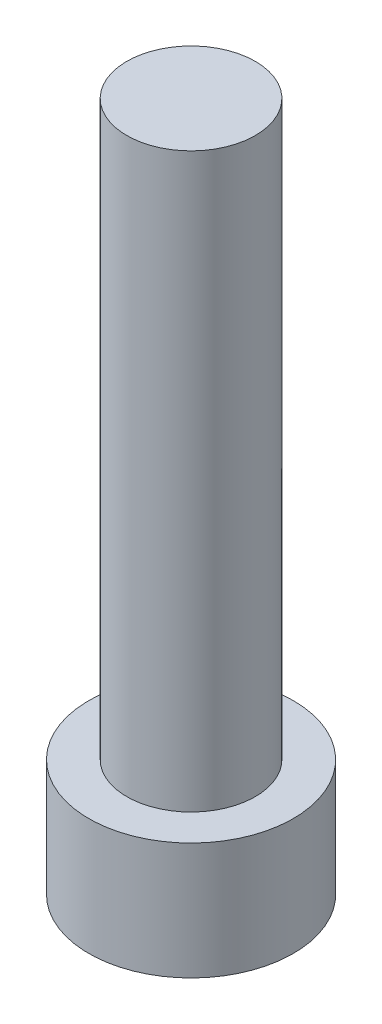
ISO-10303-21;
HEADER;
FILE_DESCRIPTION(('STEP AP214'),'2;1');
FILE_NAME('part.step','',(''),(''),'','','');
FILE_SCHEMA(('AUTOMOTIVE_DESIGN { 1 0 10303 214 1 1 1 1 }'));
ENDSEC;
DATA;
#1=APPLICATION_CONTEXT('core data for automotive mechanical design processes');
#2=APPLICATION_PROTOCOL_DEFINITION('international standard','automotive_design',2000,#1);
#3=PRODUCT_CONTEXT('',#1,'mechanical');
#4=PRODUCT('Part','Part','',(#3));
#5=PRODUCT_RELATED_PRODUCT_CATEGORY('part','',(#4));
#6=PRODUCT_DEFINITION_FORMATION('','',#4);
#7=PRODUCT_DEFINITION_CONTEXT('part definition',#1,'design');
#8=PRODUCT_DEFINITION('design','',#6,#7);
#9=PRODUCT_DEFINITION_SHAPE('','',#8);
#10=(LENGTH_UNIT() NAMED_UNIT(*) SI_UNIT(.MILLI.,.METRE.));
#11=(NAMED_UNIT(*) PLANE_ANGLE_UNIT() SI_UNIT($,.RADIAN.));
#12=(NAMED_UNIT(*) SI_UNIT($,.STERADIAN.) SOLID_ANGLE_UNIT());
#13=UNCERTAINTY_MEASURE_WITH_UNIT(LENGTH_MEASURE(1.E-05),#10,'distance_accuracy_value','');
#14=(GEOMETRIC_REPRESENTATION_CONTEXT(3) GLOBAL_UNCERTAINTY_ASSIGNED_CONTEXT((#13)) GLOBAL_UNIT_ASSIGNED_CONTEXT((#10,
#11,#12)) REPRESENTATION_CONTEXT('',''));
#15=CARTESIAN_POINT('',(0.,0.,0.));
#16=DIRECTION('',(0.,0.,1.));
#17=DIRECTION('',(1.,0.,0.));
#18=AXIS2_PLACEMENT_3D('',#15,#16,#17);
#19=CARTESIAN_POINT('',(14.518,-10.1170000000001,22.4846));
#20=DIRECTION('',(0.,1.,0.));
#21=DIRECTION('',(0.,0.,1.));
#22=AXIS2_PLACEMENT_3D('',#19,#20,#21);
#23=PLANE('',#22);
#24=DIRECTION('',(-1.,0.,0.));
#25=VECTOR('',#24,1.);
#26=CARTESIAN_POINT('',(13.883,-10.117,21.3847477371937));
#27=LINE('',#26,#25);
#28=CARTESIAN_POINT('',(13.883,-10.1170000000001,21.3847477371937));
#29=VERTEX_POINT('',#28);
#30=CARTESIAN_POINT('',(15.153,-10.1170000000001,21.3847477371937));
#31=VERTEX_POINT('',#30);
#32=EDGE_CURVE('E74',#29,#31,#27,.F.);
#33=ORIENTED_EDGE('',*,*,#32,.T.);
#34=DIRECTION('',(-0.500000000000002,0.,-0.866025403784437));
#35=VECTOR('',#34,1.);
#36=CARTESIAN_POINT('',(15.153,-10.117,21.3847477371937));
#37=LINE('',#36,#35);
#38=CARTESIAN_POINT('',(15.788,-10.1170000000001,22.4846));
#39=VERTEX_POINT('',#38);
#40=EDGE_CURVE('E77',#31,#39,#37,.F.);
#41=ORIENTED_EDGE('',*,*,#40,.T.);
#42=DIRECTION('',(0.5,0.,-0.866025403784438));
#43=VECTOR('',#42,1.);
#44=CARTESIAN_POINT('',(15.788,-10.1170000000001,22.4846));
#45=LINE('',#44,#43);
#46=CARTESIAN_POINT('',(15.153,-10.1170000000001,23.5844522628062));
#47=VERTEX_POINT('',#46);
#48=EDGE_CURVE('E95',#39,#47,#45,.F.);
#49=ORIENTED_EDGE('',*,*,#48,.T.);
#50=DIRECTION('',(1.,0.,0.));
#51=VECTOR('',#50,1.);
#52=CARTESIAN_POINT('',(15.153,-10.117,23.5844522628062));
#53=LINE('',#52,#51);
#54=CARTESIAN_POINT('',(13.883,-10.1170000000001,23.5844522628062));
#55=VERTEX_POINT('',#54);
#56=EDGE_CURVE('E100',#47,#55,#53,.F.);
#57=ORIENTED_EDGE('',*,*,#56,.T.);
#58=DIRECTION('',(0.500000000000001,0.,0.866025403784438));
#59=VECTOR('',#58,1.);
#60=CARTESIAN_POINT('',(13.883,-10.117,23.5844522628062));
#61=LINE('',#60,#59);
#62=CARTESIAN_POINT('',(13.248,-10.1170000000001,22.4846));
#63=VERTEX_POINT('',#62);
#64=EDGE_CURVE('E62',#55,#63,#61,.F.);
#65=ORIENTED_EDGE('',*,*,#64,.T.);
#66=DIRECTION('',(-0.5,0.,0.866025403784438));
#67=VECTOR('',#66,1.);
#68=CARTESIAN_POINT('',(13.248,-10.1170000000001,22.4846));
#69=LINE('',#68,#67);
#70=EDGE_CURVE('E80',#63,#29,#69,.F.);
#71=ORIENTED_EDGE('',*,*,#70,.T.);
#72=EDGE_LOOP('',(#33,#41,#49,#57,#65,#71));
#73=FACE_BOUND('',#72,.T.);
#74=ADVANCED_FACE('F16',(#73),#23,.F.);
#75=CARTESIAN_POINT('',(13.883,-11.641,21.3847477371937));
#76=DIRECTION('',(0.,0.,-1.));
#77=DIRECTION('',(-1.,0.,0.));
#78=AXIS2_PLACEMENT_3D('',#75,#76,#77);
#79=PLANE('',#78);
#80=DIRECTION('',(0.,1.,0.));
#81=VECTOR('',#80,1.);
#82=CARTESIAN_POINT('',(13.883,-11.6410000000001,21.3847477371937));
#83=LINE('',#82,#81);
#84=CARTESIAN_POINT('',(13.883,-11.641,21.3847477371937));
#85=VERTEX_POINT('',#84);
#86=EDGE_CURVE('E55',#29,#85,#83,.F.);
#87=ORIENTED_EDGE('',*,*,#86,.T.);
#88=DIRECTION('',(1.,0.,0.));
#89=VECTOR('',#88,1.);
#90=CARTESIAN_POINT('',(14.7200454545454,-11.6410000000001,21.3847477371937));
#91=LINE('',#90,#89);
#92=CARTESIAN_POINT('',(15.153,-11.641,21.3847477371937));
#93=VERTEX_POINT('',#92);
#94=EDGE_CURVE('E86',#85,#93,#91,.T.);
#95=ORIENTED_EDGE('',*,*,#94,.T.);
#96=DIRECTION('',(0.,1.,0.));
#97=VECTOR('',#96,1.);
#98=CARTESIAN_POINT('',(15.153,-11.641,21.3847477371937));
#99=LINE('',#98,#97);
#100=EDGE_CURVE('E81',#93,#31,#99,.T.);
#101=ORIENTED_EDGE('',*,*,#100,.T.);
#102=ORIENTED_EDGE('',*,*,#32,.F.);
#103=EDGE_LOOP('',(#87,#95,#101,#102));
#104=FACE_BOUND('',#103,.T.);
#105=ADVANCED_FACE('F84',(#104),#79,.F.);
#106=CARTESIAN_POINT('',(15.153,-11.641,21.3847477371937));
#107=DIRECTION('',(0.866025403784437,0.,-0.500000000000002));
#108=DIRECTION('',(-0.500000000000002,0.,-0.866025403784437));
#109=AXIS2_PLACEMENT_3D('',#106,#107,#108);
#110=PLANE('',#109);
#111=ORIENTED_EDGE('',*,*,#100,.F.);
#112=DIRECTION('',(0.500000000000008,0.,0.866025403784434));
#113=VECTOR('',#112,1.);
#114=CARTESIAN_POINT('',(15.153,-11.6410000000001,21.3847477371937));
#115=LINE('',#114,#113);
#116=CARTESIAN_POINT('',(15.788,-11.641,22.4846));
#117=VERTEX_POINT('',#116);
#118=EDGE_CURVE('E119',#93,#117,#115,.T.);
#119=ORIENTED_EDGE('',*,*,#118,.T.);
#120=DIRECTION('',(0.,1.,0.));
#121=VECTOR('',#120,1.);
#122=CARTESIAN_POINT('',(15.788,-11.6410000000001,22.4846));
#123=LINE('',#122,#121);
#124=EDGE_CURVE('E92',#117,#39,#123,.T.);
#125=ORIENTED_EDGE('',*,*,#124,.T.);
#126=ORIENTED_EDGE('',*,*,#40,.F.);
#127=EDGE_LOOP('',(#111,#119,#125,#126));
#128=FACE_BOUND('',#127,.T.);
#129=ADVANCED_FACE('F90',(#128),#110,.F.);
#130=CARTESIAN_POINT('',(15.788,-11.6410000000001,22.4846));
#131=DIRECTION('',(0.866025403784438,0.,0.5));
#132=DIRECTION('',(0.5,0.,-0.866025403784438));
#133=AXIS2_PLACEMENT_3D('',#130,#131,#132);
#134=PLANE('',#133);
#135=ORIENTED_EDGE('',*,*,#124,.F.);
#136=DIRECTION('',(-0.499999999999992,0.,0.866025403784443));
#137=VECTOR('',#136,1.);
#138=CARTESIAN_POINT('',(15.788,-11.6410000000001,22.4846));
#139=LINE('',#138,#137);
#140=CARTESIAN_POINT('',(15.153,-11.641,23.5844522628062));
#141=VERTEX_POINT('',#140);
#142=EDGE_CURVE('E117',#117,#141,#139,.T.);
#143=ORIENTED_EDGE('',*,*,#142,.T.);
#144=DIRECTION('',(0.,1.,0.));
#145=VECTOR('',#144,1.);
#146=CARTESIAN_POINT('',(15.153,-11.641,23.5844522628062));
#147=LINE('',#146,#145);
#148=EDGE_CURVE('E98',#141,#47,#147,.T.);
#149=ORIENTED_EDGE('',*,*,#148,.T.);
#150=ORIENTED_EDGE('',*,*,#48,.F.);
#151=EDGE_LOOP('',(#135,#143,#149,#150));
#152=FACE_BOUND('',#151,.T.);
#153=ADVANCED_FACE('F225',(#152),#134,.F.);
#154=CARTESIAN_POINT('',(15.153,-11.641,23.5844522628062));
#155=DIRECTION('',(0.,0.,1.));
#156=DIRECTION('',(1.,0.,0.));
#157=AXIS2_PLACEMENT_3D('',#154,#155,#156);
#158=PLANE('',#157);
#159=ORIENTED_EDGE('',*,*,#148,.F.);
#160=DIRECTION('',(1.,0.,0.));
#161=VECTOR('',#160,1.);
#162=CARTESIAN_POINT('',(14.7200454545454,-11.6410000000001,23.5844522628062));
#163=LINE('',#162,#161);
#164=CARTESIAN_POINT('',(13.883,-11.641,23.5844522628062));
#165=VERTEX_POINT('',#164);
#166=EDGE_CURVE('E115',#141,#165,#163,.F.);
#167=ORIENTED_EDGE('',*,*,#166,.T.);
#168=DIRECTION('',(0.,1.,0.));
#169=VECTOR('',#168,1.);
#170=CARTESIAN_POINT('',(13.883,-11.641,23.5844522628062));
#171=LINE('',#170,#169);
#172=EDGE_CURVE('E102',#165,#55,#171,.T.);
#173=ORIENTED_EDGE('',*,*,#172,.T.);
#174=ORIENTED_EDGE('',*,*,#56,.F.);
#175=EDGE_LOOP('',(#159,#167,#173,#174));
#176=FACE_BOUND('',#175,.T.);
#177=ADVANCED_FACE('F218',(#176),#158,.F.);
#178=CARTESIAN_POINT('',(13.883,-11.641,23.5844522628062));
#179=DIRECTION('',(-0.866025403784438,0.,0.500000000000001));
#180=DIRECTION('',(0.500000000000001,0.,0.866025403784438));
#181=AXIS2_PLACEMENT_3D('',#178,#179,#180);
#182=PLANE('',#181);
#183=ORIENTED_EDGE('',*,*,#172,.F.);
#184=DIRECTION('',(-0.499999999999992,0.,-0.866025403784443));
#185=VECTOR('',#184,1.);
#186=CARTESIAN_POINT('',(13.883,-11.6410000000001,23.5844522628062));
#187=LINE('',#186,#185);
#188=CARTESIAN_POINT('',(13.248,-11.641,22.4846));
#189=VERTEX_POINT('',#188);
#190=EDGE_CURVE('E35',#165,#189,#187,.T.);
#191=ORIENTED_EDGE('',*,*,#190,.T.);
#192=DIRECTION('',(0.,1.,0.));
#193=VECTOR('',#192,1.);
#194=CARTESIAN_POINT('',(13.248,-11.6410000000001,22.4846));
#195=LINE('',#194,#193);
#196=EDGE_CURVE('E109',#189,#63,#195,.T.);
#197=ORIENTED_EDGE('',*,*,#196,.T.);
#198=ORIENTED_EDGE('',*,*,#64,.F.);
#199=EDGE_LOOP('',(#183,#191,#197,#198));
#200=FACE_BOUND('',#199,.T.);
#201=ADVANCED_FACE('F145',(#200),#182,.F.);
#202=CARTESIAN_POINT('',(13.248,-11.6410000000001,22.4846));
#203=DIRECTION('',(-0.866025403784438,0.,-0.5));
#204=DIRECTION('',(-0.5,0.,0.866025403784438));
#205=AXIS2_PLACEMENT_3D('',#202,#203,#204);
#206=PLANE('',#205);
#207=ORIENTED_EDGE('',*,*,#196,.F.);
#208=DIRECTION('',(0.500000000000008,0.,-0.866025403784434));
#209=VECTOR('',#208,1.);
#210=CARTESIAN_POINT('',(13.248,-11.6410000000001,22.4846));
#211=LINE('',#210,#209);
#212=EDGE_CURVE('E112',#189,#85,#211,.T.);
#213=ORIENTED_EDGE('',*,*,#212,.T.);
#214=ORIENTED_EDGE('',*,*,#86,.F.);
#215=ORIENTED_EDGE('',*,*,#70,.F.);
#216=EDGE_LOOP('',(#207,#213,#214,#215));
#217=FACE_BOUND('',#216,.T.);
#218=ADVANCED_FACE('F135',(#217),#206,.F.);
#219=CARTESIAN_POINT('',(14.7200454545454,-11.6410000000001,22.4846));
#220=DIRECTION('',(0.,1.,0.));
#221=DIRECTION('',(0.,0.,1.));
#222=AXIS2_PLACEMENT_3D('',#219,#220,#221);
#223=PLANE('',#222);
#224=ORIENTED_EDGE('',*,*,#190,.F.);
#225=ORIENTED_EDGE('',*,*,#166,.F.);
#226=ORIENTED_EDGE('',*,*,#142,.F.);
#227=ORIENTED_EDGE('',*,*,#118,.F.);
#228=ORIENTED_EDGE('',*,*,#94,.F.);
#229=ORIENTED_EDGE('',*,*,#212,.F.);
#230=EDGE_LOOP('',(#224,#225,#226,#227,#228,#229));
#231=FACE_BOUND('',#230,.T.);
#232=CARTESIAN_POINT('',(14.518,-11.6410000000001,22.4846));
#233=DIRECTION('',(0.,-1.,0.));
#234=DIRECTION('',(0.,0.,-1.));
#235=AXIS2_PLACEMENT_3D('',#232,#233,#234);
#236=CIRCLE('',#235,2.2225);
#237=CARTESIAN_POINT('',(14.518,-11.6410000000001,20.2621));
#238=VERTEX_POINT('',#237);
#239=EDGE_CURVE('E20',#238,#238,#236,.F.);
#240=ORIENTED_EDGE('',*,*,#239,.F.);
#241=EDGE_LOOP('',(#240));
#242=FACE_BOUND('',#241,.T.);
#243=ADVANCED_FACE('F133',(#231,#242),#223,.F.);
#244=CARTESIAN_POINT('',(14.518,-9.10100000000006,22.4846));
#245=DIRECTION('',(0.,-1.,0.));
#246=DIRECTION('',(0.,0.,-1.));
#247=AXIS2_PLACEMENT_3D('',#244,#245,#246);
#248=CYLINDRICAL_SURFACE('',#247,2.2225);
#249=ORIENTED_EDGE('',*,*,#239,.T.);
#250=EDGE_LOOP('',(#249));
#251=FACE_BOUND('',#250,.T.);
#252=CARTESIAN_POINT('',(14.518,-9.10100000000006,22.4846));
#253=DIRECTION('',(0.,-1.,0.));
#254=DIRECTION('',(0.,0.,-1.));
#255=AXIS2_PLACEMENT_3D('',#252,#253,#254);
#256=CIRCLE('',#255,2.2225);
#257=CARTESIAN_POINT('',(14.518,-9.10100000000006,20.2621));
#258=VERTEX_POINT('',#257);
#259=EDGE_CURVE('E123',#258,#258,#256,.F.);
#260=ORIENTED_EDGE('',*,*,#259,.F.);
#261=EDGE_LOOP('',(#260));
#262=FACE_BOUND('',#261,.T.);
#263=ADVANCED_FACE('F130',(#251,#262),#248,.T.);
#264=CARTESIAN_POINT('',(14.645,3.34499999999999,22.4846));
#265=DIRECTION('',(0.,1.,0.));
#266=DIRECTION('',(0.,0.,1.));
#267=AXIS2_PLACEMENT_3D('',#264,#265,#266);
#268=PLANE('',#267);
#269=CARTESIAN_POINT('',(14.518,3.34499999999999,22.4846));
#270=DIRECTION('',(0.,-1.,0.));
#271=DIRECTION('',(0.,0.,-1.));
#272=AXIS2_PLACEMENT_3D('',#269,#270,#271);
#273=CIRCLE('',#272,1.397);
#274=CARTESIAN_POINT('',(14.518,3.34499999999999,21.0876));
#275=VERTEX_POINT('',#274);
#276=EDGE_CURVE('E26',#275,#275,#273,.T.);
#277=ORIENTED_EDGE('',*,*,#276,.F.);
#278=EDGE_LOOP('',(#277));
#279=FACE_BOUND('',#278,.T.);
#280=ADVANCED_FACE('F143',(#279),#268,.T.);
#281=CARTESIAN_POINT('',(14.7200454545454,-9.10100000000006,22.4846));
#282=DIRECTION('',(0.,1.,0.));
#283=DIRECTION('',(0.,0.,1.));
#284=AXIS2_PLACEMENT_3D('',#281,#282,#283);
#285=PLANE('',#284);
#286=CARTESIAN_POINT('',(14.518,-9.10100000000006,22.4846));
#287=DIRECTION('',(0.,-1.,0.));
#288=DIRECTION('',(0.,0.,-1.));
#289=AXIS2_PLACEMENT_3D('',#286,#287,#288);
#290=CIRCLE('',#289,1.397);
#291=CARTESIAN_POINT('',(14.518,-9.10100000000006,21.0876));
#292=VERTEX_POINT('',#291);
#293=EDGE_CURVE('E11',#292,#292,#290,.F.);
#294=ORIENTED_EDGE('',*,*,#293,.F.);
#295=EDGE_LOOP('',(#294));
#296=FACE_BOUND('',#295,.T.);
#297=ORIENTED_EDGE('',*,*,#259,.T.);
#298=EDGE_LOOP('',(#297));
#299=FACE_BOUND('',#298,.T.);
#300=ADVANCED_FACE('F149',(#296,#299),#285,.T.);
#301=CARTESIAN_POINT('',(14.518,3.34499999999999,22.4846));
#302=DIRECTION('',(0.,-1.,0.));
#303=DIRECTION('',(0.,0.,-1.));
#304=AXIS2_PLACEMENT_3D('',#301,#302,#303);
#305=CYLINDRICAL_SURFACE('',#304,1.397);
#306=ORIENTED_EDGE('',*,*,#276,.T.);
#307=EDGE_LOOP('',(#306));
#308=FACE_BOUND('',#307,.T.);
#309=ORIENTED_EDGE('',*,*,#293,.T.);
#310=EDGE_LOOP('',(#309));
#311=FACE_BOUND('',#310,.T.);
#312=ADVANCED_FACE('F18',(#308,#311),#305,.T.);
#313=CLOSED_SHELL('',(#74,#105,#129,#153,#177,#201,#218,#243,#263,#280,#300,#312));
#314=MANIFOLD_SOLID_BREP('B1',#313);
#315=ADVANCED_BREP_SHAPE_REPRESENTATION('',(#18,#314),#14);
#316=SHAPE_DEFINITION_REPRESENTATION(#9,#315);
ENDSEC;
END-ISO-10303-21;
